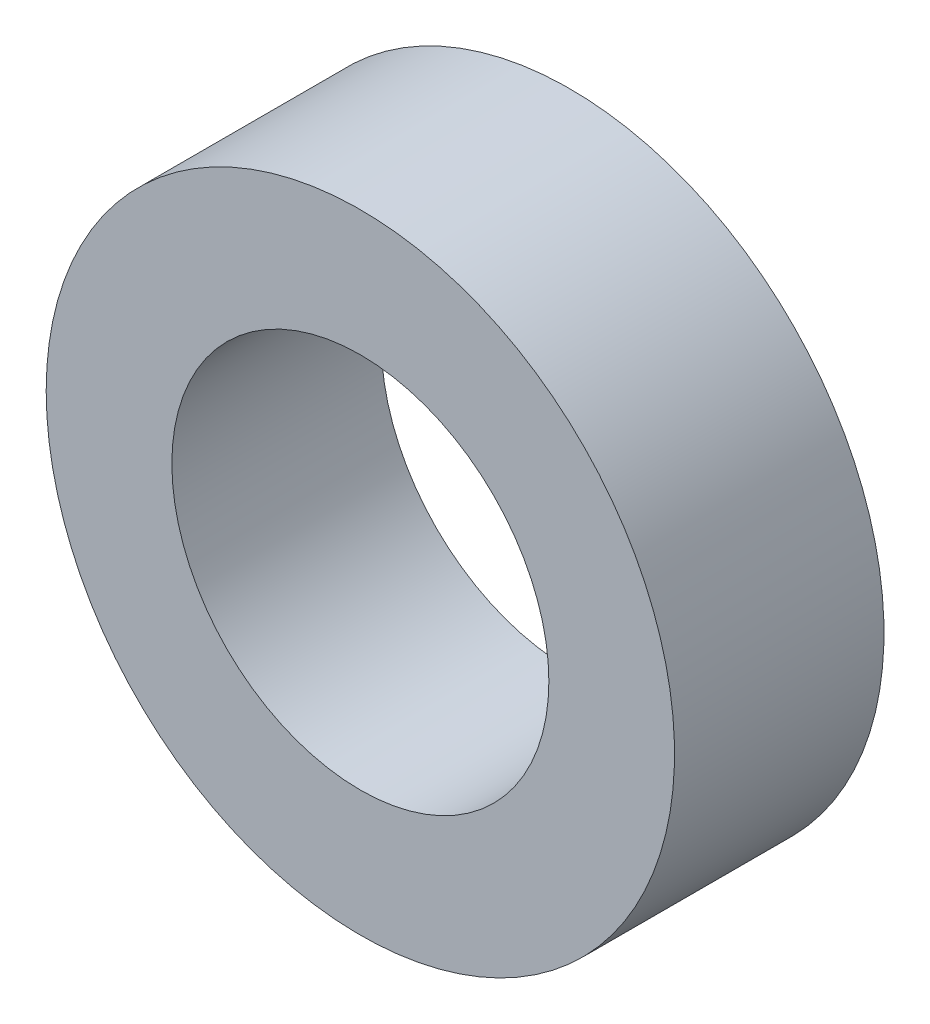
ISO-10303-21;
HEADER;
FILE_DESCRIPTION(('STEP AP214'),'2;1');
FILE_NAME('part.step','',(''),(''),'','','');
FILE_SCHEMA(('AUTOMOTIVE_DESIGN { 1 0 10303 214 1 1 1 1 }'));
ENDSEC;
DATA;
#1=APPLICATION_CONTEXT('core data for automotive mechanical design processes');
#2=APPLICATION_PROTOCOL_DEFINITION('international standard','automotive_design',2000,#1);
#3=PRODUCT_CONTEXT('',#1,'mechanical');
#4=PRODUCT('Part','Part','',(#3));
#5=PRODUCT_RELATED_PRODUCT_CATEGORY('part','',(#4));
#6=PRODUCT_DEFINITION_FORMATION('','',#4);
#7=PRODUCT_DEFINITION_CONTEXT('part definition',#1,'design');
#8=PRODUCT_DEFINITION('design','',#6,#7);
#9=PRODUCT_DEFINITION_SHAPE('','',#8);
#10=(LENGTH_UNIT() NAMED_UNIT(*) SI_UNIT(.MILLI.,.METRE.));
#11=(NAMED_UNIT(*) PLANE_ANGLE_UNIT() SI_UNIT($,.RADIAN.));
#12=(NAMED_UNIT(*) SI_UNIT($,.STERADIAN.) SOLID_ANGLE_UNIT());
#13=UNCERTAINTY_MEASURE_WITH_UNIT(LENGTH_MEASURE(1.E-05),#10,'distance_accuracy_value','');
#14=(GEOMETRIC_REPRESENTATION_CONTEXT(3) GLOBAL_UNCERTAINTY_ASSIGNED_CONTEXT((#13)) GLOBAL_UNIT_ASSIGNED_CONTEXT((#10,
#11,#12)) REPRESENTATION_CONTEXT('',''));
#15=CARTESIAN_POINT('',(0.,0.,0.));
#16=DIRECTION('',(0.,0.,1.));
#17=DIRECTION('',(1.,0.,0.));
#18=AXIS2_PLACEMENT_3D('',#15,#16,#17);
#19=CARTESIAN_POINT('',(0.,0.,-38.9763628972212));
#20=DIRECTION('',(0.,0.,-1.));
#21=DIRECTION('',(-1.,0.,0.));
#22=AXIS2_PLACEMENT_3D('',#19,#20,#21);
#23=CYLINDRICAL_SURFACE('',#22,5.715);
#24=CARTESIAN_POINT('',(0.,0.,6.35));
#25=DIRECTION('',(0.,0.,-1.));
#26=DIRECTION('',(-1.,0.,0.));
#27=AXIS2_PLACEMENT_3D('',#24,#25,#26);
#28=CIRCLE('',#27,5.715);
#29=CARTESIAN_POINT('',(-5.71500000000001,0.,6.35));
#30=VERTEX_POINT('',#29);
#31=EDGE_CURVE('E10',#30,#30,#28,.T.);
#32=ORIENTED_EDGE('',*,*,#31,.F.);
#33=EDGE_LOOP('',(#32));
#34=FACE_BOUND('',#33,.T.);
#35=CARTESIAN_POINT('',(0.,0.,0.));
#36=DIRECTION('',(0.,0.,-1.));
#37=DIRECTION('',(-1.,0.,0.));
#38=AXIS2_PLACEMENT_3D('',#35,#36,#37);
#39=CIRCLE('',#38,5.715);
#40=CARTESIAN_POINT('',(-5.71500000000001,0.,0.));
#41=VERTEX_POINT('',#40);
#42=EDGE_CURVE('E60',#41,#41,#39,.T.);
#43=ORIENTED_EDGE('',*,*,#42,.T.);
#44=EDGE_LOOP('',(#43));
#45=FACE_BOUND('',#44,.T.);
#46=ADVANCED_FACE('F41',(#34,#45),#23,.F.);
#47=CARTESIAN_POINT('',(-5.71500000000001,0.,6.35));
#48=DIRECTION('',(0.,0.,-1.));
#49=DIRECTION('',(-1.,0.,0.));
#50=AXIS2_PLACEMENT_3D('',#47,#48,#49);
#51=PLANE('',#50);
#52=CARTESIAN_POINT('',(0.,0.,6.35));
#53=DIRECTION('',(0.,0.,-1.));
#54=DIRECTION('',(-1.,0.,0.));
#55=AXIS2_PLACEMENT_3D('',#52,#53,#54);
#56=CIRCLE('',#55,9.525);
#57=CARTESIAN_POINT('',(-9.52500000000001,0.,6.35));
#58=VERTEX_POINT('',#57);
#59=EDGE_CURVE('E48',#58,#58,#56,.T.);
#60=ORIENTED_EDGE('',*,*,#59,.F.);
#61=EDGE_LOOP('',(#60));
#62=FACE_BOUND('',#61,.T.);
#63=ORIENTED_EDGE('',*,*,#31,.T.);
#64=EDGE_LOOP('',(#63));
#65=FACE_BOUND('',#64,.T.);
#66=ADVANCED_FACE('F77',(#62,#65),#51,.F.);
#67=CARTESIAN_POINT('',(0.,0.,-38.9763628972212));
#68=DIRECTION('',(0.,0.,-1.));
#69=DIRECTION('',(-1.,0.,0.));
#70=AXIS2_PLACEMENT_3D('',#67,#68,#69);
#71=CYLINDRICAL_SURFACE('',#70,9.525);
#72=CARTESIAN_POINT('',(0.,0.,0.));
#73=DIRECTION('',(0.,0.,-1.));
#74=DIRECTION('',(-1.,0.,0.));
#75=AXIS2_PLACEMENT_3D('',#72,#73,#74);
#76=CIRCLE('',#75,9.525);
#77=CARTESIAN_POINT('',(-9.52500000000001,0.,0.));
#78=VERTEX_POINT('',#77);
#79=EDGE_CURVE('E54',#78,#78,#76,.T.);
#80=ORIENTED_EDGE('',*,*,#79,.F.);
#81=EDGE_LOOP('',(#80));
#82=FACE_BOUND('',#81,.T.);
#83=ORIENTED_EDGE('',*,*,#59,.T.);
#84=EDGE_LOOP('',(#83));
#85=FACE_BOUND('',#84,.T.);
#86=ADVANCED_FACE('F72',(#82,#85),#71,.T.);
#87=CARTESIAN_POINT('',(-9.52500000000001,0.,0.));
#88=DIRECTION('',(0.,0.,1.));
#89=DIRECTION('',(1.,0.,0.));
#90=AXIS2_PLACEMENT_3D('',#87,#88,#89);
#91=PLANE('',#90);
#92=ORIENTED_EDGE('',*,*,#42,.F.);
#93=EDGE_LOOP('',(#92));
#94=FACE_BOUND('',#93,.T.);
#95=ORIENTED_EDGE('',*,*,#79,.T.);
#96=EDGE_LOOP('',(#95));
#97=FACE_BOUND('',#96,.T.);
#98=ADVANCED_FACE('F69',(#94,#97),#91,.F.);
#99=CLOSED_SHELL('',(#46,#66,#86,#98));
#100=MANIFOLD_SOLID_BREP('B2',#99);
#101=ADVANCED_BREP_SHAPE_REPRESENTATION('',(#18,#100),#14);
#102=SHAPE_DEFINITION_REPRESENTATION(#9,#101);
ENDSEC;
END-ISO-10303-21;
